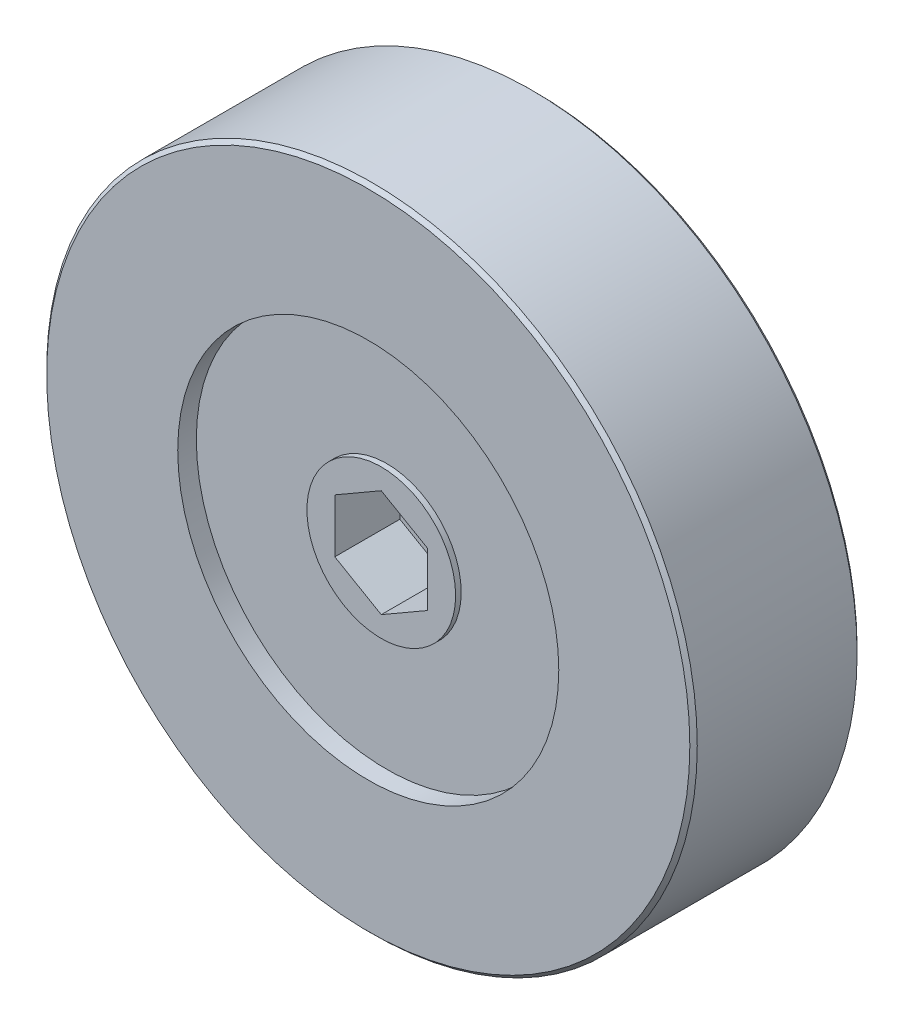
ISO-10303-21;
HEADER;
FILE_DESCRIPTION(('STEP AP214'),'2;1');
FILE_NAME('part.step','',(''),(''),'','','');
FILE_SCHEMA(('AUTOMOTIVE_DESIGN { 1 0 10303 214 1 1 1 1 }'));
ENDSEC;
DATA;
#1=APPLICATION_CONTEXT('core data for automotive mechanical design processes');
#2=APPLICATION_PROTOCOL_DEFINITION('international standard','automotive_design',2000,#1);
#3=PRODUCT_CONTEXT('',#1,'mechanical');
#4=PRODUCT('Part','Part','',(#3));
#5=PRODUCT_RELATED_PRODUCT_CATEGORY('part','',(#4));
#6=PRODUCT_DEFINITION_FORMATION('','',#4);
#7=PRODUCT_DEFINITION_CONTEXT('part definition',#1,'design');
#8=PRODUCT_DEFINITION('design','',#6,#7);
#9=PRODUCT_DEFINITION_SHAPE('','',#8);
#10=(LENGTH_UNIT() NAMED_UNIT(*) SI_UNIT(.MILLI.,.METRE.));
#11=(NAMED_UNIT(*) PLANE_ANGLE_UNIT() SI_UNIT($,.RADIAN.));
#12=(NAMED_UNIT(*) SI_UNIT($,.STERADIAN.) SOLID_ANGLE_UNIT());
#13=UNCERTAINTY_MEASURE_WITH_UNIT(LENGTH_MEASURE(1.E-05),#10,'distance_accuracy_value','');
#14=(GEOMETRIC_REPRESENTATION_CONTEXT(3) GLOBAL_UNCERTAINTY_ASSIGNED_CONTEXT((#13)) GLOBAL_UNIT_ASSIGNED_CONTEXT((#10,
#11,#12)) REPRESENTATION_CONTEXT('',''));
#15=CARTESIAN_POINT('',(0.,0.,0.));
#16=DIRECTION('',(0.,0.,1.));
#17=DIRECTION('',(1.,0.,0.));
#18=AXIS2_PLACEMENT_3D('',#15,#16,#17);
#19=CARTESIAN_POINT('',(0.,2.35,-2.));
#20=DIRECTION('',(0.,0.,1.));
#21=DIRECTION('',(1.,0.,0.));
#22=AXIS2_PLACEMENT_3D('',#19,#20,#21);
#23=PLANE('',#22);
#24=CARTESIAN_POINT('',(0.,0.,-2.));
#25=DIRECTION('',(0.,0.,1.));
#26=DIRECTION('',(1.,0.,0.));
#27=AXIS2_PLACEMENT_3D('',#24,#25,#26);
#28=CIRCLE('',#27,3.);
#29=CARTESIAN_POINT('',(3.,0.,-2.));
#30=VERTEX_POINT('',#29);
#31=EDGE_CURVE('E115',#30,#30,#28,.T.);
#32=ORIENTED_EDGE('',*,*,#31,.T.);
#33=EDGE_LOOP('',(#32));
#34=FACE_BOUND('',#33,.T.);
#35=CARTESIAN_POINT('',(0.,0.,-2.));
#36=DIRECTION('',(0.,0.,1.));
#37=DIRECTION('',(1.,0.,0.));
#38=AXIS2_PLACEMENT_3D('',#35,#36,#37);
#39=CIRCLE('',#38,2.35);
#40=CARTESIAN_POINT('',(2.35,0.,-2.));
#41=VERTEX_POINT('',#40);
#42=EDGE_CURVE('E9',#41,#41,#39,.T.);
#43=ORIENTED_EDGE('',*,*,#42,.F.);
#44=EDGE_LOOP('',(#43));
#45=FACE_BOUND('',#44,.T.);
#46=ADVANCED_FACE('F14',(#34,#45),#23,.T.);
#47=CARTESIAN_POINT('',(0.,0.,13.));
#48=DIRECTION('',(0.,0.,1.));
#49=DIRECTION('',(1.,0.,0.));
#50=AXIS2_PLACEMENT_3D('',#47,#48,#49);
#51=CYLINDRICAL_SURFACE('',#50,2.35);
#52=ORIENTED_EDGE('',*,*,#42,.T.);
#53=EDGE_LOOP('',(#52));
#54=FACE_BOUND('',#53,.T.);
#55=CARTESIAN_POINT('',(0.,0.,0.));
#56=DIRECTION('',(0.,0.,1.));
#57=DIRECTION('',(1.,0.,0.));
#58=AXIS2_PLACEMENT_3D('',#55,#56,#57);
#59=CIRCLE('',#58,2.35);
#60=CARTESIAN_POINT('',(2.35,0.,0.));
#61=VERTEX_POINT('',#60);
#62=EDGE_CURVE('E21',#61,#61,#59,.T.);
#63=ORIENTED_EDGE('',*,*,#62,.F.);
#64=EDGE_LOOP('',(#63));
#65=FACE_BOUND('',#64,.T.);
#66=ADVANCED_FACE('F170',(#54,#65),#51,.T.);
#67=CARTESIAN_POINT('',(0.,5.1,0.));
#68=DIRECTION('',(0.,0.,-1.));
#69=DIRECTION('',(-1.,0.,0.));
#70=AXIS2_PLACEMENT_3D('',#67,#68,#69);
#71=PLANE('',#70);
#72=ORIENTED_EDGE('',*,*,#62,.T.);
#73=EDGE_LOOP('',(#72));
#74=FACE_BOUND('',#73,.T.);
#75=CARTESIAN_POINT('',(0.,0.,0.));
#76=DIRECTION('',(0.,0.,1.));
#77=DIRECTION('',(1.,0.,0.));
#78=AXIS2_PLACEMENT_3D('',#75,#76,#77);
#79=CIRCLE('',#78,5.1);
#80=CARTESIAN_POINT('',(5.1,0.,0.));
#81=VERTEX_POINT('',#80);
#82=EDGE_CURVE('E162',#81,#81,#79,.T.);
#83=ORIENTED_EDGE('',*,*,#82,.F.);
#84=EDGE_LOOP('',(#83));
#85=FACE_BOUND('',#84,.T.);
#86=ADVANCED_FACE('F167',(#74,#85),#71,.T.);
#87=CARTESIAN_POINT('',(0.,0.,13.));
#88=DIRECTION('',(0.,0.,1.));
#89=DIRECTION('',(1.,0.,0.));
#90=AXIS2_PLACEMENT_3D('',#87,#88,#89);
#91=CYLINDRICAL_SURFACE('',#90,5.1);
#92=ORIENTED_EDGE('',*,*,#82,.T.);
#93=EDGE_LOOP('',(#92));
#94=FACE_BOUND('',#93,.T.);
#95=CARTESIAN_POINT('',(0.,0.,2.));
#96=DIRECTION('',(0.,0.,1.));
#97=DIRECTION('',(1.,0.,0.));
#98=AXIS2_PLACEMENT_3D('',#95,#96,#97);
#99=CIRCLE('',#98,5.1);
#100=CARTESIAN_POINT('',(5.1,0.,2.));
#101=VERTEX_POINT('',#100);
#102=EDGE_CURVE('E159',#101,#101,#99,.T.);
#103=ORIENTED_EDGE('',*,*,#102,.F.);
#104=EDGE_LOOP('',(#103));
#105=FACE_BOUND('',#104,.T.);
#106=ADVANCED_FACE('F179',(#94,#105),#91,.T.);
#107=CARTESIAN_POINT('',(0.,5.1,2.));
#108=DIRECTION('',(0.,0.,-1.));
#109=DIRECTION('',(-1.,0.,0.));
#110=AXIS2_PLACEMENT_3D('',#107,#108,#109);
#111=PLANE('',#110);
#112=ORIENTED_EDGE('',*,*,#102,.T.);
#113=EDGE_LOOP('',(#112));
#114=FACE_BOUND('',#113,.T.);
#115=CARTESIAN_POINT('',(0.,0.,2.));
#116=DIRECTION('',(0.,0.,1.));
#117=DIRECTION('',(1.,0.,0.));
#118=AXIS2_PLACEMENT_3D('',#115,#116,#117);
#119=CIRCLE('',#118,10.25);
#120=CARTESIAN_POINT('',(10.25,0.,2.));
#121=VERTEX_POINT('',#120);
#122=EDGE_CURVE('E156',#121,#121,#119,.T.);
#123=ORIENTED_EDGE('',*,*,#122,.F.);
#124=EDGE_LOOP('',(#123));
#125=FACE_BOUND('',#124,.T.);
#126=ADVANCED_FACE('F185',(#114,#125),#111,.T.);
#127=CARTESIAN_POINT('',(0.,0.,13.));
#128=DIRECTION('',(0.,0.,1.));
#129=DIRECTION('',(1.,0.,0.));
#130=AXIS2_PLACEMENT_3D('',#127,#128,#129);
#131=CYLINDRICAL_SURFACE('',#130,10.25);
#132=ORIENTED_EDGE('',*,*,#122,.T.);
#133=EDGE_LOOP('',(#132));
#134=FACE_BOUND('',#133,.T.);
#135=CARTESIAN_POINT('',(0.,0.,1.));
#136=DIRECTION('',(0.,0.,1.));
#137=DIRECTION('',(1.,0.,0.));
#138=AXIS2_PLACEMENT_3D('',#135,#136,#137);
#139=CIRCLE('',#138,10.25);
#140=CARTESIAN_POINT('',(10.25,0.,1.));
#141=VERTEX_POINT('',#140);
#142=EDGE_CURVE('E153',#141,#141,#139,.T.);
#143=ORIENTED_EDGE('',*,*,#142,.F.);
#144=EDGE_LOOP('',(#143));
#145=FACE_BOUND('',#144,.T.);
#146=ADVANCED_FACE('F189',(#134,#145),#131,.F.);
#147=CARTESIAN_POINT('',(0.,17.3,1.));
#148=DIRECTION('',(0.,0.,-1.));
#149=DIRECTION('',(-1.,0.,0.));
#150=AXIS2_PLACEMENT_3D('',#147,#148,#149);
#151=PLANE('',#150);
#152=ORIENTED_EDGE('',*,*,#142,.T.);
#153=EDGE_LOOP('',(#152));
#154=FACE_BOUND('',#153,.T.);
#155=CARTESIAN_POINT('',(0.,0.,1.));
#156=DIRECTION('',(0.,0.,1.));
#157=DIRECTION('',(1.,0.,0.));
#158=AXIS2_PLACEMENT_3D('',#155,#156,#157);
#159=CIRCLE('',#158,17.3);
#160=CARTESIAN_POINT('',(17.3,0.,1.));
#161=VERTEX_POINT('',#160);
#162=EDGE_CURVE('E150',#161,#161,#159,.T.);
#163=ORIENTED_EDGE('',*,*,#162,.F.);
#164=EDGE_LOOP('',(#163));
#165=FACE_BOUND('',#164,.T.);
#166=ADVANCED_FACE('F193',(#154,#165),#151,.T.);
#167=CARTESIAN_POINT('',(0.,0.,1.2));
#168=DIRECTION('',(0.,0.,1.));
#169=DIRECTION('',(1.,0.,0.));
#170=AXIS2_PLACEMENT_3D('',#167,#168,#169);
#171=CONICAL_SURFACE('',#170,17.5,0.785398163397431);
#172=ORIENTED_EDGE('',*,*,#162,.T.);
#173=EDGE_LOOP('',(#172));
#174=FACE_BOUND('',#173,.T.);
#175=CARTESIAN_POINT('',(0.,0.,1.2));
#176=DIRECTION('',(0.,0.,1.));
#177=DIRECTION('',(1.,0.,0.));
#178=AXIS2_PLACEMENT_3D('',#175,#176,#177);
#179=CIRCLE('',#178,17.5);
#180=CARTESIAN_POINT('',(17.5,0.,1.2));
#181=VERTEX_POINT('',#180);
#182=EDGE_CURVE('E147',#181,#181,#179,.T.);
#183=ORIENTED_EDGE('',*,*,#182,.F.);
#184=EDGE_LOOP('',(#183));
#185=FACE_BOUND('',#184,.T.);
#186=ADVANCED_FACE('F197',(#174,#185),#171,.T.);
#187=CARTESIAN_POINT('',(0.,0.,13.));
#188=DIRECTION('',(0.,0.,1.));
#189=DIRECTION('',(1.,0.,0.));
#190=AXIS2_PLACEMENT_3D('',#187,#188,#189);
#191=CYLINDRICAL_SURFACE('',#190,17.5);
#192=ORIENTED_EDGE('',*,*,#182,.T.);
#193=EDGE_LOOP('',(#192));
#194=FACE_BOUND('',#193,.T.);
#195=CARTESIAN_POINT('',(0.,0.,9.8));
#196=DIRECTION('',(0.,0.,1.));
#197=DIRECTION('',(1.,0.,0.));
#198=AXIS2_PLACEMENT_3D('',#195,#196,#197);
#199=CIRCLE('',#198,17.5);
#200=CARTESIAN_POINT('',(17.5,0.,9.8));
#201=VERTEX_POINT('',#200);
#202=EDGE_CURVE('E144',#201,#201,#199,.T.);
#203=ORIENTED_EDGE('',*,*,#202,.F.);
#204=EDGE_LOOP('',(#203));
#205=FACE_BOUND('',#204,.T.);
#206=ADVANCED_FACE('F201',(#194,#205),#191,.T.);
#207=CARTESIAN_POINT('',(0.,0.,9.99999999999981));
#208=DIRECTION('',(0.,0.,-1.));
#209=DIRECTION('',(-1.,0.,0.));
#210=AXIS2_PLACEMENT_3D('',#207,#208,#209);
#211=CONICAL_SURFACE('',#210,17.3,0.785398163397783);
#212=ORIENTED_EDGE('',*,*,#202,.T.);
#213=EDGE_LOOP('',(#212));
#214=FACE_BOUND('',#213,.T.);
#215=CARTESIAN_POINT('',(0.,0.,9.99999999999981));
#216=DIRECTION('',(0.,0.,1.));
#217=DIRECTION('',(1.,0.,0.));
#218=AXIS2_PLACEMENT_3D('',#215,#216,#217);
#219=CIRCLE('',#218,17.3);
#220=CARTESIAN_POINT('',(17.3,0.,9.99999999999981));
#221=VERTEX_POINT('',#220);
#222=EDGE_CURVE('E141',#221,#221,#219,.T.);
#223=ORIENTED_EDGE('',*,*,#222,.F.);
#224=EDGE_LOOP('',(#223));
#225=FACE_BOUND('',#224,.T.);
#226=ADVANCED_FACE('F205',(#214,#225),#211,.T.);
#227=CARTESIAN_POINT('',(0.,17.3,10.));
#228=DIRECTION('',(0.,0.,1.));
#229=DIRECTION('',(1.,0.,0.));
#230=AXIS2_PLACEMENT_3D('',#227,#228,#229);
#231=PLANE('',#230);
#232=ORIENTED_EDGE('',*,*,#222,.T.);
#233=EDGE_LOOP('',(#232));
#234=FACE_BOUND('',#233,.T.);
#235=CARTESIAN_POINT('',(0.,0.,10.));
#236=DIRECTION('',(0.,0.,1.));
#237=DIRECTION('',(1.,0.,0.));
#238=AXIS2_PLACEMENT_3D('',#235,#236,#237);
#239=CIRCLE('',#238,10.25);
#240=CARTESIAN_POINT('',(10.25,0.,10.));
#241=VERTEX_POINT('',#240);
#242=EDGE_CURVE('E138',#241,#241,#239,.T.);
#243=ORIENTED_EDGE('',*,*,#242,.F.);
#244=EDGE_LOOP('',(#243));
#245=FACE_BOUND('',#244,.T.);
#246=ADVANCED_FACE('F209',(#234,#245),#231,.T.);
#247=CARTESIAN_POINT('',(0.,0.,13.));
#248=DIRECTION('',(0.,0.,1.));
#249=DIRECTION('',(1.,0.,0.));
#250=AXIS2_PLACEMENT_3D('',#247,#248,#249);
#251=CYLINDRICAL_SURFACE('',#250,10.25);
#252=ORIENTED_EDGE('',*,*,#242,.T.);
#253=EDGE_LOOP('',(#252));
#254=FACE_BOUND('',#253,.T.);
#255=CARTESIAN_POINT('',(0.,0.,9.));
#256=DIRECTION('',(0.,0.,1.));
#257=DIRECTION('',(1.,0.,0.));
#258=AXIS2_PLACEMENT_3D('',#255,#256,#257);
#259=CIRCLE('',#258,10.25);
#260=CARTESIAN_POINT('',(10.25,0.,9.));
#261=VERTEX_POINT('',#260);
#262=EDGE_CURVE('E135',#261,#261,#259,.T.);
#263=ORIENTED_EDGE('',*,*,#262,.F.);
#264=EDGE_LOOP('',(#263));
#265=FACE_BOUND('',#264,.T.);
#266=ADVANCED_FACE('F213',(#254,#265),#251,.F.);
#267=CARTESIAN_POINT('',(0.,10.25,9.));
#268=DIRECTION('',(0.,0.,1.));
#269=DIRECTION('',(1.,0.,0.));
#270=AXIS2_PLACEMENT_3D('',#267,#268,#269);
#271=PLANE('',#270);
#272=ORIENTED_EDGE('',*,*,#262,.T.);
#273=EDGE_LOOP('',(#272));
#274=FACE_BOUND('',#273,.T.);
#275=CARTESIAN_POINT('',(0.,0.,9.));
#276=DIRECTION('',(0.,0.,1.));
#277=DIRECTION('',(1.,0.,0.));
#278=AXIS2_PLACEMENT_3D('',#275,#276,#277);
#279=CIRCLE('',#278,4.00000000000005);
#280=CARTESIAN_POINT('',(4.00000000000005,0.,9.));
#281=VERTEX_POINT('',#280);
#282=EDGE_CURVE('E132',#281,#281,#279,.T.);
#283=ORIENTED_EDGE('',*,*,#282,.F.);
#284=EDGE_LOOP('',(#283));
#285=FACE_BOUND('',#284,.T.);
#286=ADVANCED_FACE('F217',(#274,#285),#271,.T.);
#287=CARTESIAN_POINT('',(0.,0.,13.));
#288=DIRECTION('',(0.,0.,1.));
#289=DIRECTION('',(1.,0.,0.));
#290=AXIS2_PLACEMENT_3D('',#287,#288,#289);
#291=CYLINDRICAL_SURFACE('',#290,4.00000000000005);
#292=ORIENTED_EDGE('',*,*,#282,.T.);
#293=EDGE_LOOP('',(#292));
#294=FACE_BOUND('',#293,.T.);
#295=CARTESIAN_POINT('',(0.,0.,9.3));
#296=DIRECTION('',(0.,0.,1.));
#297=DIRECTION('',(1.,0.,0.));
#298=AXIS2_PLACEMENT_3D('',#295,#296,#297);
#299=CIRCLE('',#298,4.00000000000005);
#300=CARTESIAN_POINT('',(4.00000000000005,0.,9.3));
#301=VERTEX_POINT('',#300);
#302=EDGE_CURVE('E129',#301,#301,#299,.T.);
#303=ORIENTED_EDGE('',*,*,#302,.F.);
#304=EDGE_LOOP('',(#303));
#305=FACE_BOUND('',#304,.T.);
#306=ADVANCED_FACE('F221',(#294,#305),#291,.T.);
#307=CARTESIAN_POINT('',(0.,4.00000000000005,9.3));
#308=DIRECTION('',(0.,0.,1.));
#309=DIRECTION('',(1.,0.,0.));
#310=AXIS2_PLACEMENT_3D('',#307,#308,#309);
#311=PLANE('',#310);
#312=DIRECTION('',(-0.866025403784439,0.5,0.));
#313=VECTOR('',#312,1.);
#314=CARTESIAN_POINT('',(2.5,1.44337567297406,9.3));
#315=LINE('',#314,#313);
#316=CARTESIAN_POINT('',(2.5,1.44337567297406,9.3));
#317=VERTEX_POINT('',#316);
#318=CARTESIAN_POINT('',(0.,2.88675134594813,9.3));
#319=VERTEX_POINT('',#318);
#320=EDGE_CURVE('E28',#317,#319,#315,.T.);
#321=ORIENTED_EDGE('',*,*,#320,.F.);
#322=DIRECTION('',(0.,1.,0.));
#323=VECTOR('',#322,1.);
#324=CARTESIAN_POINT('',(2.5,-1.44337567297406,9.3));
#325=LINE('',#324,#323);
#326=CARTESIAN_POINT('',(2.5,-1.44337567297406,9.3));
#327=VERTEX_POINT('',#326);
#328=EDGE_CURVE('E111',#327,#317,#325,.T.);
#329=ORIENTED_EDGE('',*,*,#328,.F.);
#330=DIRECTION('',(0.866025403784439,0.5,0.));
#331=VECTOR('',#330,1.);
#332=CARTESIAN_POINT('',(0.,-2.88675134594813,9.3));
#333=LINE('',#332,#331);
#334=CARTESIAN_POINT('',(0.,-2.88675134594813,9.3));
#335=VERTEX_POINT('',#334);
#336=EDGE_CURVE('E109',#335,#327,#333,.T.);
#337=ORIENTED_EDGE('',*,*,#336,.F.);
#338=DIRECTION('',(0.866025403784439,-0.5,0.));
#339=VECTOR('',#338,1.);
#340=CARTESIAN_POINT('',(-2.5,-1.44337567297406,9.3));
#341=LINE('',#340,#339);
#342=CARTESIAN_POINT('',(-2.5,-1.44337567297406,9.3));
#343=VERTEX_POINT('',#342);
#344=EDGE_CURVE('E76',#343,#335,#341,.T.);
#345=ORIENTED_EDGE('',*,*,#344,.F.);
#346=DIRECTION('',(0.,-1.,0.));
#347=VECTOR('',#346,1.);
#348=CARTESIAN_POINT('',(-2.5,1.44337567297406,9.3));
#349=LINE('',#348,#347);
#350=CARTESIAN_POINT('',(-2.5,1.44337567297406,9.3));
#351=VERTEX_POINT('',#350);
#352=EDGE_CURVE('E105',#351,#343,#349,.T.);
#353=ORIENTED_EDGE('',*,*,#352,.F.);
#354=DIRECTION('',(-0.866025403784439,-0.5,0.));
#355=VECTOR('',#354,1.);
#356=CARTESIAN_POINT('',(0.,2.88675134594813,9.3));
#357=LINE('',#356,#355);
#358=EDGE_CURVE('E102',#319,#351,#357,.T.);
#359=ORIENTED_EDGE('',*,*,#358,.F.);
#360=EDGE_LOOP('',(#321,#329,#337,#345,#353,#359));
#361=FACE_BOUND('',#360,.T.);
#362=ORIENTED_EDGE('',*,*,#302,.T.);
#363=EDGE_LOOP('',(#362));
#364=FACE_BOUND('',#363,.T.);
#365=ADVANCED_FACE('F225',(#361,#364),#311,.T.);
#366=CARTESIAN_POINT('',(0.,0.,-8.));
#367=DIRECTION('',(0.,0.,-1.));
#368=DIRECTION('',(-1.,0.,0.));
#369=AXIS2_PLACEMENT_3D('',#366,#367,#368);
#370=PLANE('',#369);
#371=CARTESIAN_POINT('',(0.,0.,-8.));
#372=DIRECTION('',(0.,0.,1.));
#373=DIRECTION('',(1.,0.,0.));
#374=AXIS2_PLACEMENT_3D('',#371,#372,#373);
#375=CIRCLE('',#374,2.5);
#376=CARTESIAN_POINT('',(2.5,0.,-8.));
#377=VERTEX_POINT('',#376);
#378=EDGE_CURVE('E126',#377,#377,#375,.T.);
#379=ORIENTED_EDGE('',*,*,#378,.F.);
#380=EDGE_LOOP('',(#379));
#381=FACE_BOUND('',#380,.T.);
#382=ADVANCED_FACE('F229',(#381),#370,.T.);
#383=CARTESIAN_POINT('',(0.,0.,-7.5));
#384=DIRECTION('',(0.,0.,1.));
#385=DIRECTION('',(1.,0.,0.));
#386=AXIS2_PLACEMENT_3D('',#383,#384,#385);
#387=CONICAL_SURFACE('',#386,3.,0.785398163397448);
#388=ORIENTED_EDGE('',*,*,#378,.T.);
#389=EDGE_LOOP('',(#388));
#390=FACE_BOUND('',#389,.T.);
#391=CARTESIAN_POINT('',(0.,0.,-7.5));
#392=DIRECTION('',(0.,0.,1.));
#393=DIRECTION('',(1.,0.,0.));
#394=AXIS2_PLACEMENT_3D('',#391,#392,#393);
#395=CIRCLE('',#394,3.);
#396=CARTESIAN_POINT('',(3.,0.,-7.5));
#397=VERTEX_POINT('',#396);
#398=EDGE_CURVE('E123',#397,#397,#395,.T.);
#399=ORIENTED_EDGE('',*,*,#398,.F.);
#400=EDGE_LOOP('',(#399));
#401=FACE_BOUND('',#400,.T.);
#402=ADVANCED_FACE('F233',(#390,#401),#387,.T.);
#403=CARTESIAN_POINT('',(0.,0.,13.));
#404=DIRECTION('',(0.,0.,1.));
#405=DIRECTION('',(1.,0.,0.));
#406=AXIS2_PLACEMENT_3D('',#403,#404,#405);
#407=CYLINDRICAL_SURFACE('',#406,3.);
#408=ORIENTED_EDGE('',*,*,#398,.T.);
#409=EDGE_LOOP('',(#408));
#410=FACE_BOUND('',#409,.T.);
#411=ORIENTED_EDGE('',*,*,#31,.F.);
#412=EDGE_LOOP('',(#411));
#413=FACE_BOUND('',#412,.T.);
#414=ADVANCED_FACE('F237',(#410,#413),#407,.T.);
#415=CARTESIAN_POINT('',(2.5,1.44337567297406,5.8));
#416=DIRECTION('',(0.5,0.866025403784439,0.));
#417=DIRECTION('',(-0.866025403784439,0.5,0.));
#418=AXIS2_PLACEMENT_3D('',#415,#416,#417);
#419=PLANE('',#418);
#420=ORIENTED_EDGE('',*,*,#320,.T.);
#421=DIRECTION('',(0.,0.,1.));
#422=VECTOR('',#421,1.);
#423=CARTESIAN_POINT('',(0.,2.88675134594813,5.8));
#424=LINE('',#423,#422);
#425=CARTESIAN_POINT('',(0.,2.88675134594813,5.8));
#426=VERTEX_POINT('',#425);
#427=EDGE_CURVE('E58',#426,#319,#424,.T.);
#428=ORIENTED_EDGE('',*,*,#427,.F.);
#429=DIRECTION('',(-0.866025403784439,0.5,0.));
#430=VECTOR('',#429,1.);
#431=CARTESIAN_POINT('',(2.5,1.44337567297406,5.8));
#432=LINE('',#431,#430);
#433=CARTESIAN_POINT('',(2.5,1.44337567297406,5.8));
#434=VERTEX_POINT('',#433);
#435=EDGE_CURVE('E113',#434,#426,#432,.T.);
#436=ORIENTED_EDGE('',*,*,#435,.F.);
#437=DIRECTION('',(0.,0.,1.));
#438=VECTOR('',#437,1.);
#439=CARTESIAN_POINT('',(2.5,1.44337567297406,5.8));
#440=LINE('',#439,#438);
#441=EDGE_CURVE('E36',#434,#317,#440,.T.);
#442=ORIENTED_EDGE('',*,*,#441,.T.);
#443=EDGE_LOOP('',(#420,#428,#436,#442));
#444=FACE_BOUND('',#443,.T.);
#445=ADVANCED_FACE('F241',(#444),#419,.F.);
#446=CARTESIAN_POINT('',(2.5,-1.44337567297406,5.8));
#447=DIRECTION('',(1.,0.,0.));
#448=DIRECTION('',(0.,0.,-1.));
#449=AXIS2_PLACEMENT_3D('',#446,#447,#448);
#450=PLANE('',#449);
#451=ORIENTED_EDGE('',*,*,#328,.T.);
#452=ORIENTED_EDGE('',*,*,#441,.F.);
#453=DIRECTION('',(0.,1.,0.));
#454=VECTOR('',#453,1.);
#455=CARTESIAN_POINT('',(2.5,-1.44337567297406,5.8));
#456=LINE('',#455,#454);
#457=CARTESIAN_POINT('',(2.5,-1.44337567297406,5.8));
#458=VERTEX_POINT('',#457);
#459=EDGE_CURVE('E88',#458,#434,#456,.T.);
#460=ORIENTED_EDGE('',*,*,#459,.F.);
#461=DIRECTION('',(0.,0.,1.));
#462=VECTOR('',#461,1.);
#463=CARTESIAN_POINT('',(2.5,-1.44337567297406,5.8));
#464=LINE('',#463,#462);
#465=EDGE_CURVE('E80',#458,#327,#464,.T.);
#466=ORIENTED_EDGE('',*,*,#465,.T.);
#467=EDGE_LOOP('',(#451,#452,#460,#466));
#468=FACE_BOUND('',#467,.T.);
#469=ADVANCED_FACE('F245',(#468),#450,.F.);
#470=CARTESIAN_POINT('',(0.,-2.88675134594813,5.8));
#471=DIRECTION('',(0.5,-0.866025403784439,0.));
#472=DIRECTION('',(0.866025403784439,0.5,0.));
#473=AXIS2_PLACEMENT_3D('',#470,#471,#472);
#474=PLANE('',#473);
#475=ORIENTED_EDGE('',*,*,#336,.T.);
#476=ORIENTED_EDGE('',*,*,#465,.F.);
#477=DIRECTION('',(0.866025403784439,0.5,0.));
#478=VECTOR('',#477,1.);
#479=CARTESIAN_POINT('',(0.,-2.88675134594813,5.8));
#480=LINE('',#479,#478);
#481=CARTESIAN_POINT('',(0.,-2.88675134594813,5.8));
#482=VERTEX_POINT('',#481);
#483=EDGE_CURVE('E84',#482,#458,#480,.T.);
#484=ORIENTED_EDGE('',*,*,#483,.F.);
#485=DIRECTION('',(0.,0.,1.));
#486=VECTOR('',#485,1.);
#487=CARTESIAN_POINT('',(0.,-2.88675134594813,5.8));
#488=LINE('',#487,#486);
#489=EDGE_CURVE('E69',#482,#335,#488,.T.);
#490=ORIENTED_EDGE('',*,*,#489,.T.);
#491=EDGE_LOOP('',(#475,#476,#484,#490));
#492=FACE_BOUND('',#491,.T.);
#493=ADVANCED_FACE('F85',(#492),#474,.F.);
#494=CARTESIAN_POINT('',(-2.5,-1.44337567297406,5.8));
#495=DIRECTION('',(-0.5,-0.866025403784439,0.));
#496=DIRECTION('',(0.866025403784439,-0.5,0.));
#497=AXIS2_PLACEMENT_3D('',#494,#495,#496);
#498=PLANE('',#497);
#499=ORIENTED_EDGE('',*,*,#344,.T.);
#500=ORIENTED_EDGE('',*,*,#489,.F.);
#501=DIRECTION('',(0.866025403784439,-0.5,0.));
#502=VECTOR('',#501,1.);
#503=CARTESIAN_POINT('',(-2.5,-1.44337567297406,5.8));
#504=LINE('',#503,#502);
#505=CARTESIAN_POINT('',(-2.5,-1.44337567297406,5.8));
#506=VERTEX_POINT('',#505);
#507=EDGE_CURVE('E73',#506,#482,#504,.T.);
#508=ORIENTED_EDGE('',*,*,#507,.F.);
#509=DIRECTION('',(0.,0.,1.));
#510=VECTOR('',#509,1.);
#511=CARTESIAN_POINT('',(-2.5,-1.44337567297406,5.8));
#512=LINE('',#511,#510);
#513=EDGE_CURVE('E81',#506,#343,#512,.T.);
#514=ORIENTED_EDGE('',*,*,#513,.T.);
#515=EDGE_LOOP('',(#499,#500,#508,#514));
#516=FACE_BOUND('',#515,.T.);
#517=ADVANCED_FACE('F71',(#516),#498,.F.);
#518=CARTESIAN_POINT('',(-2.5,1.44337567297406,5.8));
#519=DIRECTION('',(-1.,0.,0.));
#520=DIRECTION('',(0.,-1.,0.));
#521=AXIS2_PLACEMENT_3D('',#518,#519,#520);
#522=PLANE('',#521);
#523=ORIENTED_EDGE('',*,*,#352,.T.);
#524=ORIENTED_EDGE('',*,*,#513,.F.);
#525=DIRECTION('',(0.,-1.,0.));
#526=VECTOR('',#525,1.);
#527=CARTESIAN_POINT('',(-2.5,1.44337567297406,5.8));
#528=LINE('',#527,#526);
#529=CARTESIAN_POINT('',(-2.5,1.44337567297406,5.8));
#530=VERTEX_POINT('',#529);
#531=EDGE_CURVE('E94',#530,#506,#528,.T.);
#532=ORIENTED_EDGE('',*,*,#531,.F.);
#533=DIRECTION('',(0.,0.,1.));
#534=VECTOR('',#533,1.);
#535=CARTESIAN_POINT('',(-2.5,1.44337567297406,5.8));
#536=LINE('',#535,#534);
#537=EDGE_CURVE('E118',#530,#351,#536,.T.);
#538=ORIENTED_EDGE('',*,*,#537,.T.);
#539=EDGE_LOOP('',(#523,#524,#532,#538));
#540=FACE_BOUND('',#539,.T.);
#541=ADVANCED_FACE('F249',(#540),#522,.F.);
#542=CARTESIAN_POINT('',(0.,2.88675134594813,5.8));
#543=DIRECTION('',(-0.5,0.866025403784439,0.));
#544=DIRECTION('',(-0.866025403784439,-0.5,0.));
#545=AXIS2_PLACEMENT_3D('',#542,#543,#544);
#546=PLANE('',#545);
#547=ORIENTED_EDGE('',*,*,#358,.T.);
#548=ORIENTED_EDGE('',*,*,#537,.F.);
#549=DIRECTION('',(-0.866025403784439,-0.5,0.));
#550=VECTOR('',#549,1.);
#551=CARTESIAN_POINT('',(0.,2.88675134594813,5.8));
#552=LINE('',#551,#550);
#553=EDGE_CURVE('E96',#426,#530,#552,.T.);
#554=ORIENTED_EDGE('',*,*,#553,.F.);
#555=ORIENTED_EDGE('',*,*,#427,.T.);
#556=EDGE_LOOP('',(#547,#548,#554,#555));
#557=FACE_BOUND('',#556,.T.);
#558=ADVANCED_FACE('F246',(#557),#546,.F.);
#559=CARTESIAN_POINT('',(0.,0.,5.8));
#560=DIRECTION('',(0.,0.,1.));
#561=DIRECTION('',(1.,0.,0.));
#562=AXIS2_PLACEMENT_3D('',#559,#560,#561);
#563=PLANE('',#562);
#564=ORIENTED_EDGE('',*,*,#435,.T.);
#565=ORIENTED_EDGE('',*,*,#553,.T.);
#566=ORIENTED_EDGE('',*,*,#531,.T.);
#567=ORIENTED_EDGE('',*,*,#507,.T.);
#568=ORIENTED_EDGE('',*,*,#483,.T.);
#569=ORIENTED_EDGE('',*,*,#459,.T.);
#570=EDGE_LOOP('',(#564,#565,#566,#567,#568,#569));
#571=FACE_BOUND('',#570,.T.);
#572=ADVANCED_FACE('F91',(#571),#563,.T.);
#573=CLOSED_SHELL('',(#46,#66,#86,#106,#126,#146,#166,#186,#206,#226,#246,#266,#286,#306,#365,
#382,#402,#414,#445,#469,#493,#517,#541,#558,#572));
#574=MANIFOLD_SOLID_BREP('B1',#573);
#575=ADVANCED_BREP_SHAPE_REPRESENTATION('',(#18,#574),#14);
#576=SHAPE_DEFINITION_REPRESENTATION(#9,#575);
ENDSEC;
END-ISO-10303-21;
